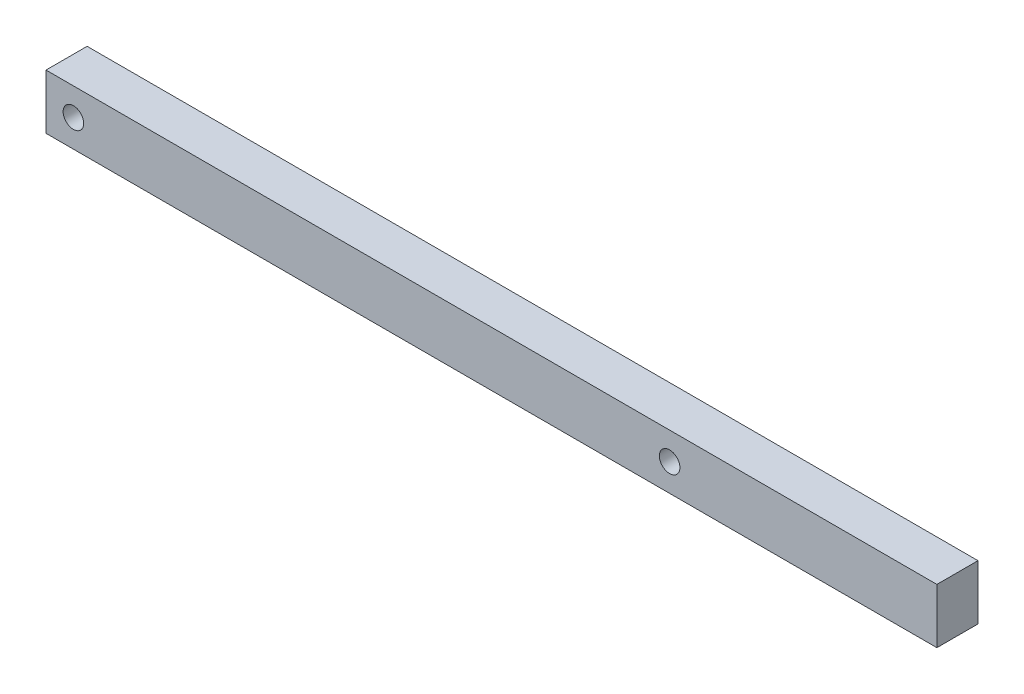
from build123d import *

# Parameters (mm, degrees)
ESQUISSE1_W      = 130
ESQUISSE1_H      = 8
ESQUISSE1_R      = 1.5
EXTRUSION1_DEPTH = 6


with BuildPart() as part:
    # Esquisse1 → Extrusion1 (new body)
    with BuildSketch(Plane.XY):
        with Locations((61, 0)):
            Rectangle(ESQUISSE1_W, ESQUISSE1_H)
        Circle(ESQUISSE1_R, mode=Mode.SUBTRACT)
        with Locations((87, 0)):
            Circle(ESQUISSE1_R, mode=Mode.SUBTRACT)
    extrude(amount=EXTRUSION1_DEPTH)


solid = part.part
